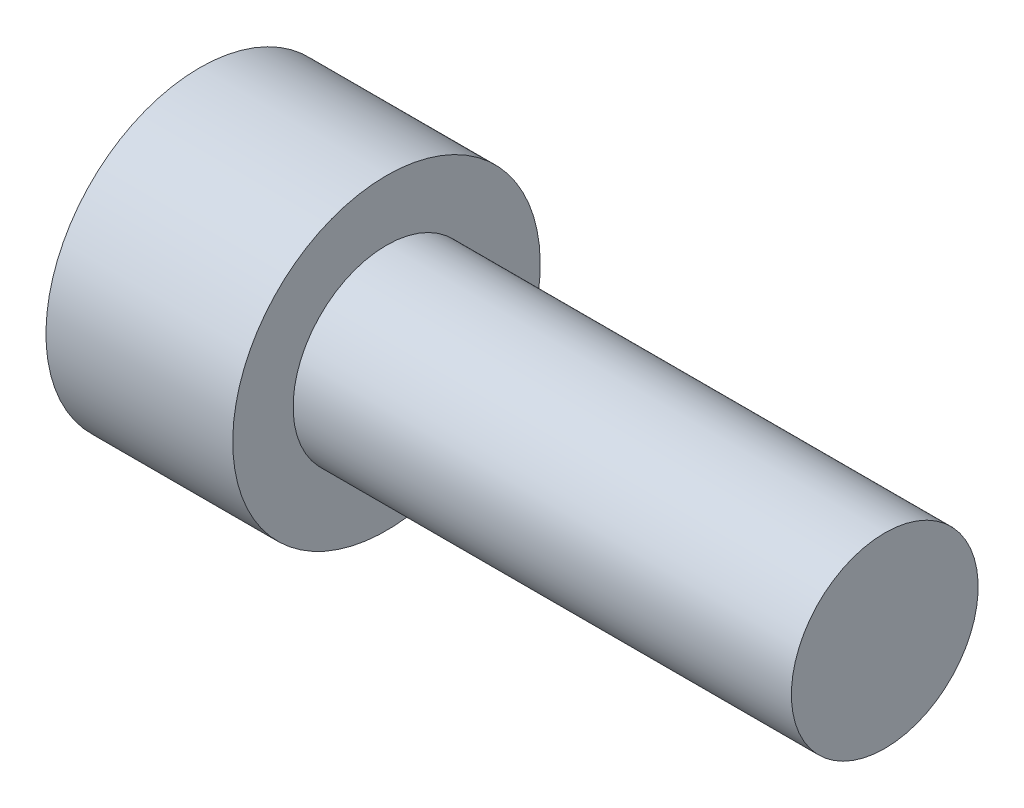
ISO-10303-21;
HEADER;
FILE_DESCRIPTION(('STEP AP214'),'2;1');
FILE_NAME('part.step','',(''),(''),'','','');
FILE_SCHEMA(('AUTOMOTIVE_DESIGN { 1 0 10303 214 1 1 1 1 }'));
ENDSEC;
DATA;
#1=APPLICATION_CONTEXT('core data for automotive mechanical design processes');
#2=APPLICATION_PROTOCOL_DEFINITION('international standard','automotive_design',2000,#1);
#3=PRODUCT_CONTEXT('',#1,'mechanical');
#4=PRODUCT('Part','Part','',(#3));
#5=PRODUCT_RELATED_PRODUCT_CATEGORY('part','',(#4));
#6=PRODUCT_DEFINITION_FORMATION('','',#4);
#7=PRODUCT_DEFINITION_CONTEXT('part definition',#1,'design');
#8=PRODUCT_DEFINITION('design','',#6,#7);
#9=PRODUCT_DEFINITION_SHAPE('','',#8);
#10=(LENGTH_UNIT() NAMED_UNIT(*) SI_UNIT(.MILLI.,.METRE.));
#11=(NAMED_UNIT(*) PLANE_ANGLE_UNIT() SI_UNIT($,.RADIAN.));
#12=(NAMED_UNIT(*) SI_UNIT($,.STERADIAN.) SOLID_ANGLE_UNIT());
#13=UNCERTAINTY_MEASURE_WITH_UNIT(LENGTH_MEASURE(1.E-05),#10,'distance_accuracy_value','');
#14=(GEOMETRIC_REPRESENTATION_CONTEXT(3) GLOBAL_UNCERTAINTY_ASSIGNED_CONTEXT((#13)) GLOBAL_UNIT_ASSIGNED_CONTEXT((#10,
#11,#12)) REPRESENTATION_CONTEXT('',''));
#15=CARTESIAN_POINT('',(0.,0.,0.));
#16=DIRECTION('',(0.,0.,1.));
#17=DIRECTION('',(1.,0.,0.));
#18=AXIS2_PLACEMENT_3D('',#15,#16,#17);
#19=CARTESIAN_POINT('',(15.2781,0.,0.));
#20=DIRECTION('',(1.,0.,0.));
#21=DIRECTION('',(0.,1.,0.));
#22=AXIS2_PLACEMENT_3D('',#19,#20,#21);
#23=PLANE('',#22);
#24=CARTESIAN_POINT('',(15.2781,0.,0.));
#25=DIRECTION('',(1.,0.,0.));
#26=DIRECTION('',(0.,1.,0.));
#27=AXIS2_PLACEMENT_3D('',#24,#25,#26);
#28=CIRCLE('',#27,2.08280000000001);
#29=CARTESIAN_POINT('',(15.2781,2.0828,0.));
#30=VERTEX_POINT('',#29);
#31=EDGE_CURVE('E11',#30,#30,#28,.T.);
#32=ORIENTED_EDGE('',*,*,#31,.T.);
#33=EDGE_LOOP('',(#32));
#34=FACE_BOUND('',#33,.T.);
#35=ADVANCED_FACE('F380',(#34),#23,.T.);
#36=CARTESIAN_POINT('',(15.2781,0.,0.));
#37=DIRECTION('',(1.,0.,0.));
#38=DIRECTION('',(0.,1.,0.));
#39=AXIS2_PLACEMENT_3D('',#36,#37,#38);
#40=CYLINDRICAL_SURFACE('',#39,2.0828);
#41=CARTESIAN_POINT('',(4.1656,0.,0.));
#42=DIRECTION('',(1.,0.,0.));
#43=DIRECTION('',(0.,1.,0.));
#44=AXIS2_PLACEMENT_3D('',#41,#42,#43);
#45=CIRCLE('',#44,2.0828);
#46=CARTESIAN_POINT('',(4.1656,2.0828,0.));
#47=VERTEX_POINT('',#46);
#48=EDGE_CURVE('E387',#47,#47,#45,.T.);
#49=ORIENTED_EDGE('',*,*,#48,.T.);
#50=EDGE_LOOP('',(#49));
#51=FACE_BOUND('',#50,.T.);
#52=ORIENTED_EDGE('',*,*,#31,.F.);
#53=EDGE_LOOP('',(#52));
#54=FACE_BOUND('',#53,.T.);
#55=ADVANCED_FACE('F496',(#51,#54),#40,.T.);
#56=CARTESIAN_POINT('',(4.1656,3.429,0.));
#57=DIRECTION('',(1.,0.,0.));
#58=DIRECTION('',(0.,1.,0.));
#59=AXIS2_PLACEMENT_3D('',#56,#57,#58);
#60=PLANE('',#59);
#61=CARTESIAN_POINT('',(4.1656,0.,0.));
#62=DIRECTION('',(1.,0.,0.));
#63=DIRECTION('',(0.,1.,0.));
#64=AXIS2_PLACEMENT_3D('',#61,#62,#63);
#65=CIRCLE('',#64,3.429);
#66=CARTESIAN_POINT('',(4.1656,3.429,0.));
#67=VERTEX_POINT('',#66);
#68=EDGE_CURVE('E491',#67,#67,#65,.T.);
#69=ORIENTED_EDGE('',*,*,#68,.T.);
#70=EDGE_LOOP('',(#69));
#71=FACE_BOUND('',#70,.T.);
#72=ORIENTED_EDGE('',*,*,#48,.F.);
#73=EDGE_LOOP('',(#72));
#74=FACE_BOUND('',#73,.T.);
#75=ADVANCED_FACE('F499',(#71,#74),#60,.T.);
#76=CARTESIAN_POINT('',(15.2781,0.,0.));
#77=DIRECTION('',(1.,0.,0.));
#78=DIRECTION('',(0.,1.,0.));
#79=AXIS2_PLACEMENT_3D('',#76,#77,#78);
#80=CYLINDRICAL_SURFACE('',#79,3.429);
#81=CARTESIAN_POINT('',(0.,0.,0.));
#82=DIRECTION('',(1.,0.,0.));
#83=DIRECTION('',(0.,1.,0.));
#84=AXIS2_PLACEMENT_3D('',#81,#82,#83);
#85=CIRCLE('',#84,3.429);
#86=CARTESIAN_POINT('',(0.,3.429,0.));
#87=VERTEX_POINT('',#86);
#88=EDGE_CURVE('E482',#87,#87,#85,.T.);
#89=ORIENTED_EDGE('',*,*,#88,.T.);
#90=EDGE_LOOP('',(#89));
#91=FACE_BOUND('',#90,.T.);
#92=ORIENTED_EDGE('',*,*,#68,.F.);
#93=EDGE_LOOP('',(#92));
#94=FACE_BOUND('',#93,.T.);
#95=ADVANCED_FACE('F501',(#91,#94),#80,.T.);
#96=CARTESIAN_POINT('',(0.,0.,0.));
#97=DIRECTION('',(-1.,0.,0.));
#98=DIRECTION('',(0.,-1.,0.));
#99=AXIS2_PLACEMENT_3D('',#96,#97,#98);
#100=PLANE('',#99);
#101=DIRECTION('',(0.,0.866025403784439,0.5));
#102=VECTOR('',#101,1.);
#103=CARTESIAN_POINT('',(0.,-1.7859375,1.03111149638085));
#104=LINE('',#103,#102);
#105=CARTESIAN_POINT('',(0.,-1.7859375,1.03111149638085));
#106=VERTEX_POINT('',#105);
#107=CARTESIAN_POINT('',(0.,0.,2.06222299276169));
#108=VERTEX_POINT('',#107);
#109=EDGE_CURVE('E394',#106,#108,#104,.T.);
#110=ORIENTED_EDGE('',*,*,#109,.F.);
#111=DIRECTION('',(0.,0.,1.));
#112=VECTOR('',#111,1.);
#113=CARTESIAN_POINT('',(0.,-1.7859375,-1.03111149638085));
#114=LINE('',#113,#112);
#115=CARTESIAN_POINT('',(0.,-1.7859375,-1.03111149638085));
#116=VERTEX_POINT('',#115);
#117=EDGE_CURVE('E464',#116,#106,#114,.T.);
#118=ORIENTED_EDGE('',*,*,#117,.F.);
#119=DIRECTION('',(0.,-0.866025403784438,0.5));
#120=VECTOR('',#119,1.);
#121=CARTESIAN_POINT('',(0.,0.,-2.06222299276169));
#122=LINE('',#121,#120);
#123=CARTESIAN_POINT('',(0.,0.,-2.06222299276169));
#124=VERTEX_POINT('',#123);
#125=EDGE_CURVE('E458',#124,#116,#122,.T.);
#126=ORIENTED_EDGE('',*,*,#125,.F.);
#127=DIRECTION('',(0.,-0.866025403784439,-0.499999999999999));
#128=VECTOR('',#127,1.);
#129=CARTESIAN_POINT('',(0.,1.7859375,-1.03111149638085));
#130=LINE('',#129,#128);
#131=CARTESIAN_POINT('',(0.,1.7859375,-1.03111149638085));
#132=VERTEX_POINT('',#131);
#133=EDGE_CURVE('E456',#132,#124,#130,.T.);
#134=ORIENTED_EDGE('',*,*,#133,.F.);
#135=DIRECTION('',(0.,0.,-1.));
#136=VECTOR('',#135,1.);
#137=CARTESIAN_POINT('',(0.,1.7859375,1.03111149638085));
#138=LINE('',#137,#136);
#139=CARTESIAN_POINT('',(0.,1.7859375,1.03111149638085));
#140=VERTEX_POINT('',#139);
#141=EDGE_CURVE('E437',#140,#132,#138,.T.);
#142=ORIENTED_EDGE('',*,*,#141,.F.);
#143=DIRECTION('',(0.,0.866025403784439,-0.5));
#144=VECTOR('',#143,1.);
#145=CARTESIAN_POINT('',(0.,0.,2.06222299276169));
#146=LINE('',#145,#144);
#147=EDGE_CURVE('E448',#108,#140,#146,.T.);
#148=ORIENTED_EDGE('',*,*,#147,.F.);
#149=EDGE_LOOP('',(#110,#118,#126,#134,#142,#148));
#150=FACE_BOUND('',#149,.T.);
#151=ORIENTED_EDGE('',*,*,#88,.F.);
#152=EDGE_LOOP('',(#151));
#153=FACE_BOUND('',#152,.T.);
#154=ADVANCED_FACE('F452',(#150,#153),#100,.T.);
#155=CARTESIAN_POINT('',(2.54,-1.7859375,1.03111149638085));
#156=DIRECTION('',(0.,-0.5,0.866025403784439));
#157=DIRECTION('',(0.,-0.866025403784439,-0.5));
#158=AXIS2_PLACEMENT_3D('',#155,#156,#157);
#159=PLANE('',#158);
#160=ORIENTED_EDGE('',*,*,#109,.T.);
#161=DIRECTION('',(-1.,0.,0.));
#162=VECTOR('',#161,1.);
#163=CARTESIAN_POINT('',(2.54,0.,2.06222299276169));
#164=LINE('',#163,#162);
#165=CARTESIAN_POINT('',(2.54,0.,2.06222299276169));
#166=VERTEX_POINT('',#165);
#167=EDGE_CURVE('E445',#166,#108,#164,.T.);
#168=ORIENTED_EDGE('',*,*,#167,.F.);
#169=DIRECTION('',(0.,0.866025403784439,0.5));
#170=VECTOR('',#169,1.);
#171=CARTESIAN_POINT('',(2.54,-1.7859375,1.03111149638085));
#172=LINE('',#171,#170);
#173=CARTESIAN_POINT('',(2.54,-1.7859375,1.03111149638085));
#174=VERTEX_POINT('',#173);
#175=EDGE_CURVE('E466',#174,#166,#172,.T.);
#176=ORIENTED_EDGE('',*,*,#175,.F.);
#177=DIRECTION('',(-1.,0.,0.));
#178=VECTOR('',#177,1.);
#179=CARTESIAN_POINT('',(2.54,-1.7859375,1.03111149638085));
#180=LINE('',#179,#178);
#181=EDGE_CURVE('E401',#174,#106,#180,.T.);
#182=ORIENTED_EDGE('',*,*,#181,.T.);
#183=EDGE_LOOP('',(#160,#168,#176,#182));
#184=FACE_BOUND('',#183,.T.);
#185=ADVANCED_FACE('F532',(#184),#159,.F.);
#186=CARTESIAN_POINT('',(2.54,-1.7859375,-1.03111149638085));
#187=DIRECTION('',(0.,-1.,0.));
#188=DIRECTION('',(1.,0.,0.));
#189=AXIS2_PLACEMENT_3D('',#186,#187,#188);
#190=PLANE('',#189);
#191=ORIENTED_EDGE('',*,*,#117,.T.);
#192=ORIENTED_EDGE('',*,*,#181,.F.);
#193=DIRECTION('',(0.,0.,1.));
#194=VECTOR('',#193,1.);
#195=CARTESIAN_POINT('',(2.54,-1.7859375,-1.03111149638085));
#196=LINE('',#195,#194);
#197=CARTESIAN_POINT('',(2.54,-1.7859375,-1.03111149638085));
#198=VERTEX_POINT('',#197);
#199=EDGE_CURVE('E478',#198,#174,#196,.T.);
#200=ORIENTED_EDGE('',*,*,#199,.F.);
#201=DIRECTION('',(-1.,0.,0.));
#202=VECTOR('',#201,1.);
#203=CARTESIAN_POINT('',(2.54,-1.7859375,-1.03111149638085));
#204=LINE('',#203,#202);
#205=EDGE_CURVE('E483',#198,#116,#204,.T.);
#206=ORIENTED_EDGE('',*,*,#205,.T.);
#207=EDGE_LOOP('',(#191,#192,#200,#206));
#208=FACE_BOUND('',#207,.T.);
#209=ADVANCED_FACE('F539',(#208),#190,.F.);
#210=CARTESIAN_POINT('',(2.54,0.,-2.06222299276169));
#211=DIRECTION('',(0.,-0.5,-0.866025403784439));
#212=DIRECTION('',(0.,0.866025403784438,-0.5));
#213=AXIS2_PLACEMENT_3D('',#210,#211,#212);
#214=PLANE('',#213);
#215=ORIENTED_EDGE('',*,*,#125,.T.);
#216=ORIENTED_EDGE('',*,*,#205,.F.);
#217=DIRECTION('',(0.,-0.866025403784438,0.5));
#218=VECTOR('',#217,1.);
#219=CARTESIAN_POINT('',(2.54,0.,-2.06222299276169));
#220=LINE('',#219,#218);
#221=CARTESIAN_POINT('',(2.54,0.,-2.06222299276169));
#222=VERTEX_POINT('',#221);
#223=EDGE_CURVE('E475',#222,#198,#220,.T.);
#224=ORIENTED_EDGE('',*,*,#223,.F.);
#225=DIRECTION('',(-1.,0.,0.));
#226=VECTOR('',#225,1.);
#227=CARTESIAN_POINT('',(2.54,0.,-2.06222299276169));
#228=LINE('',#227,#226);
#229=EDGE_CURVE('E485',#222,#124,#228,.T.);
#230=ORIENTED_EDGE('',*,*,#229,.T.);
#231=EDGE_LOOP('',(#215,#216,#224,#230));
#232=FACE_BOUND('',#231,.T.);
#233=ADVANCED_FACE('F546',(#232),#214,.F.);
#234=CARTESIAN_POINT('',(2.54,1.7859375,-1.03111149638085));
#235=DIRECTION('',(0.,0.499999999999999,-0.866025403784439));
#236=DIRECTION('',(0.,0.866025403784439,0.5));
#237=AXIS2_PLACEMENT_3D('',#234,#235,#236);
#238=PLANE('',#237);
#239=ORIENTED_EDGE('',*,*,#133,.T.);
#240=ORIENTED_EDGE('',*,*,#229,.F.);
#241=DIRECTION('',(0.,-0.866025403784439,-0.499999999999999));
#242=VECTOR('',#241,1.);
#243=CARTESIAN_POINT('',(2.54,1.7859375,-1.03111149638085));
#244=LINE('',#243,#242);
#245=CARTESIAN_POINT('',(2.54,1.7859375,-1.03111149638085));
#246=VERTEX_POINT('',#245);
#247=EDGE_CURVE('E472',#246,#222,#244,.T.);
#248=ORIENTED_EDGE('',*,*,#247,.F.);
#249=DIRECTION('',(-1.,0.,0.));
#250=VECTOR('',#249,1.);
#251=CARTESIAN_POINT('',(2.54,1.7859375,-1.03111149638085));
#252=LINE('',#251,#250);
#253=EDGE_CURVE('E444',#246,#132,#252,.T.);
#254=ORIENTED_EDGE('',*,*,#253,.T.);
#255=EDGE_LOOP('',(#239,#240,#248,#254));
#256=FACE_BOUND('',#255,.T.);
#257=ADVANCED_FACE('F553',(#256),#238,.F.);
#258=CARTESIAN_POINT('',(2.54,1.7859375,1.03111149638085));
#259=DIRECTION('',(0.,1.,0.));
#260=DIRECTION('',(-1.,0.,0.));
#261=AXIS2_PLACEMENT_3D('',#258,#259,#260);
#262=PLANE('',#261);
#263=ORIENTED_EDGE('',*,*,#141,.T.);
#264=ORIENTED_EDGE('',*,*,#253,.F.);
#265=DIRECTION('',(0.,0.,-1.));
#266=VECTOR('',#265,1.);
#267=CARTESIAN_POINT('',(2.54,1.7859375,1.03111149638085));
#268=LINE('',#267,#266);
#269=CARTESIAN_POINT('',(2.54,1.7859375,1.03111149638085));
#270=VERTEX_POINT('',#269);
#271=EDGE_CURVE('E440',#270,#246,#268,.T.);
#272=ORIENTED_EDGE('',*,*,#271,.F.);
#273=DIRECTION('',(-1.,0.,0.));
#274=VECTOR('',#273,1.);
#275=CARTESIAN_POINT('',(2.54,1.7859375,1.03111149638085));
#276=LINE('',#275,#274);
#277=EDGE_CURVE('E433',#270,#140,#276,.T.);
#278=ORIENTED_EDGE('',*,*,#277,.T.);
#279=EDGE_LOOP('',(#263,#264,#272,#278));
#280=FACE_BOUND('',#279,.T.);
#281=ADVANCED_FACE('F435',(#280),#262,.F.);
#282=CARTESIAN_POINT('',(2.54,0.,2.06222299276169));
#283=DIRECTION('',(0.,0.5,0.866025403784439));
#284=DIRECTION('',(0.,-0.866025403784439,0.5));
#285=AXIS2_PLACEMENT_3D('',#282,#283,#284);
#286=PLANE('',#285);
#287=ORIENTED_EDGE('',*,*,#147,.T.);
#288=ORIENTED_EDGE('',*,*,#277,.F.);
#289=DIRECTION('',(0.,0.866025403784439,-0.5));
#290=VECTOR('',#289,1.);
#291=CARTESIAN_POINT('',(2.54,0.,2.06222299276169));
#292=LINE('',#291,#290);
#293=EDGE_CURVE('E469',#166,#270,#292,.T.);
#294=ORIENTED_EDGE('',*,*,#293,.F.);
#295=ORIENTED_EDGE('',*,*,#167,.T.);
#296=EDGE_LOOP('',(#287,#288,#294,#295));
#297=FACE_BOUND('',#296,.T.);
#298=ADVANCED_FACE('F449',(#297),#286,.F.);
#299=CARTESIAN_POINT('',(2.54,1.7859375,3.09333448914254));
#300=DIRECTION('',(-1.,0.,0.));
#301=DIRECTION('',(0.,-1.,0.));
#302=AXIS2_PLACEMENT_3D('',#299,#300,#301);
#303=PLANE('',#302);
#304=ORIENTED_EDGE('',*,*,#175,.T.);
#305=ORIENTED_EDGE('',*,*,#293,.T.);
#306=ORIENTED_EDGE('',*,*,#271,.T.);
#307=ORIENTED_EDGE('',*,*,#247,.T.);
#308=ORIENTED_EDGE('',*,*,#223,.T.);
#309=ORIENTED_EDGE('',*,*,#199,.T.);
#310=EDGE_LOOP('',(#304,#305,#306,#307,#308,#309));
#311=FACE_BOUND('',#310,.T.);
#312=ADVANCED_FACE('F574',(#311),#303,.T.);
#313=CLOSED_SHELL('',(#35,#55,#75,#95,#154,#185,#209,#233,#257,#281,#298,#312));
#314=MANIFOLD_SOLID_BREP('B2',#313);
#315=ADVANCED_BREP_SHAPE_REPRESENTATION('',(#18,#314),#14);
#316=SHAPE_DEFINITION_REPRESENTATION(#9,#315);
ENDSEC;
END-ISO-10303-21;
